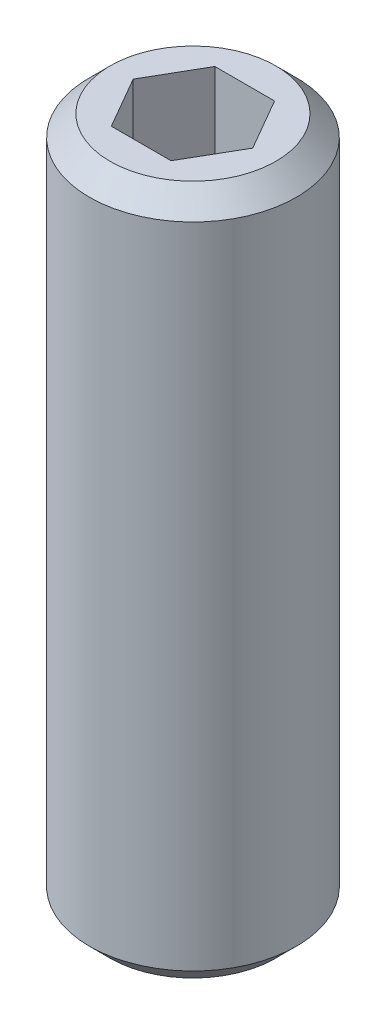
ISO-10303-21;
HEADER;
FILE_DESCRIPTION(('STEP AP214'),'2;1');
FILE_NAME('part.step','',(''),(''),'','','');
FILE_SCHEMA(('AUTOMOTIVE_DESIGN { 1 0 10303 214 1 1 1 1 }'));
ENDSEC;
DATA;
#1=APPLICATION_CONTEXT('core data for automotive mechanical design processes');
#2=APPLICATION_PROTOCOL_DEFINITION('international standard','automotive_design',2000,#1);
#3=PRODUCT_CONTEXT('',#1,'mechanical');
#4=PRODUCT('Part','Part','',(#3));
#5=PRODUCT_RELATED_PRODUCT_CATEGORY('part','',(#4));
#6=PRODUCT_DEFINITION_FORMATION('','',#4);
#7=PRODUCT_DEFINITION_CONTEXT('part definition',#1,'design');
#8=PRODUCT_DEFINITION('design','',#6,#7);
#9=PRODUCT_DEFINITION_SHAPE('','',#8);
#10=(LENGTH_UNIT() NAMED_UNIT(*) SI_UNIT(.MILLI.,.METRE.));
#11=(NAMED_UNIT(*) PLANE_ANGLE_UNIT() SI_UNIT($,.RADIAN.));
#12=(NAMED_UNIT(*) SI_UNIT($,.STERADIAN.) SOLID_ANGLE_UNIT());
#13=UNCERTAINTY_MEASURE_WITH_UNIT(LENGTH_MEASURE(1.E-05),#10,'distance_accuracy_value','');
#14=(GEOMETRIC_REPRESENTATION_CONTEXT(3) GLOBAL_UNCERTAINTY_ASSIGNED_CONTEXT((#13)) GLOBAL_UNIT_ASSIGNED_CONTEXT((#10,
#11,#12)) REPRESENTATION_CONTEXT('',''));
#15=CARTESIAN_POINT('',(0.,0.,0.));
#16=DIRECTION('',(0.,0.,1.));
#17=DIRECTION('',(1.,0.,0.));
#18=AXIS2_PLACEMENT_3D('',#15,#16,#17);
#19=CARTESIAN_POINT('',(0.,-20.,0.));
#20=DIRECTION('',(0.,1.,0.));
#21=DIRECTION('',(0.,0.,1.));
#22=AXIS2_PLACEMENT_3D('',#19,#20,#21);
#23=CYLINDRICAL_SURFACE('',#22,3.);
#24=CARTESIAN_POINT('',(0.,-0.600000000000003,0.));
#25=DIRECTION('',(0.,1.,0.));
#26=DIRECTION('',(0.,0.,1.));
#27=AXIS2_PLACEMENT_3D('',#24,#25,#26);
#28=CIRCLE('',#27,3.);
#29=CARTESIAN_POINT('',(0.,-0.600000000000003,3.));
#30=VERTEX_POINT('',#29);
#31=EDGE_CURVE('E39',#30,#30,#28,.F.);
#32=ORIENTED_EDGE('',*,*,#31,.T.);
#33=EDGE_LOOP('',(#32));
#34=FACE_BOUND('',#33,.T.);
#35=CARTESIAN_POINT('',(0.,-19.4,0.));
#36=DIRECTION('',(0.,1.,0.));
#37=DIRECTION('',(0.,0.,1.));
#38=AXIS2_PLACEMENT_3D('',#35,#36,#37);
#39=CIRCLE('',#38,3.);
#40=CARTESIAN_POINT('',(0.,-19.4,3.));
#41=VERTEX_POINT('',#40);
#42=EDGE_CURVE('E142',#41,#41,#39,.T.);
#43=ORIENTED_EDGE('',*,*,#42,.T.);
#44=EDGE_LOOP('',(#43));
#45=FACE_BOUND('',#44,.T.);
#46=ADVANCED_FACE('F32',(#34,#45),#23,.T.);
#47=CARTESIAN_POINT('',(0.,-20.,0.));
#48=DIRECTION('',(0.,1.,0.));
#49=DIRECTION('',(0.,0.,1.));
#50=AXIS2_PLACEMENT_3D('',#47,#48,#49);
#51=PLANE('',#50);
#52=CARTESIAN_POINT('',(0.,-20.,0.));
#53=DIRECTION('',(0.,1.,0.));
#54=DIRECTION('',(0.,0.,1.));
#55=AXIS2_PLACEMENT_3D('',#52,#53,#54);
#56=CIRCLE('',#55,2.39999999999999);
#57=CARTESIAN_POINT('',(0.,-20.,2.39999999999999));
#58=VERTEX_POINT('',#57);
#59=EDGE_CURVE('E11',#58,#58,#56,.F.);
#60=ORIENTED_EDGE('',*,*,#59,.T.);
#61=EDGE_LOOP('',(#60));
#62=FACE_BOUND('',#61,.T.);
#63=ADVANCED_FACE('F159',(#62),#51,.F.);
#64=CARTESIAN_POINT('',(0.,0.,0.));
#65=DIRECTION('',(0.,1.,0.));
#66=DIRECTION('',(0.,0.,1.));
#67=AXIS2_PLACEMENT_3D('',#64,#65,#66);
#68=PLANE('',#67);
#69=CARTESIAN_POINT('',(0.,0.,0.));
#70=DIRECTION('',(0.,1.,0.));
#71=DIRECTION('',(0.,0.,1.));
#72=AXIS2_PLACEMENT_3D('',#69,#70,#71);
#73=CIRCLE('',#72,2.4);
#74=CARTESIAN_POINT('',(0.,0.,2.4));
#75=VERTEX_POINT('',#74);
#76=EDGE_CURVE('E133',#75,#75,#73,.T.);
#77=ORIENTED_EDGE('',*,*,#76,.T.);
#78=EDGE_LOOP('',(#77));
#79=FACE_BOUND('',#78,.T.);
#80=DIRECTION('',(-1.,0.,0.));
#81=VECTOR('',#80,1.);
#82=CARTESIAN_POINT('',(0.866025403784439,0.,-1.5));
#83=LINE('',#82,#81);
#84=CARTESIAN_POINT('',(0.866025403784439,0.,-1.5));
#85=VERTEX_POINT('',#84);
#86=CARTESIAN_POINT('',(-0.866025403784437,0.,-1.5));
#87=VERTEX_POINT('',#86);
#88=EDGE_CURVE('E46',#85,#87,#83,.T.);
#89=ORIENTED_EDGE('',*,*,#88,.F.);
#90=DIRECTION('',(-0.5,0.,-0.866025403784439));
#91=VECTOR('',#90,1.);
#92=CARTESIAN_POINT('',(1.73205080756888,0.,0.));
#93=LINE('',#92,#91);
#94=CARTESIAN_POINT('',(1.73205080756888,0.,0.));
#95=VERTEX_POINT('',#94);
#96=EDGE_CURVE('E115',#95,#85,#93,.T.);
#97=ORIENTED_EDGE('',*,*,#96,.F.);
#98=DIRECTION('',(0.5,0.,-0.866025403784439));
#99=VECTOR('',#98,1.);
#100=CARTESIAN_POINT('',(0.866025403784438,0.,1.5));
#101=LINE('',#100,#99);
#102=CARTESIAN_POINT('',(0.866025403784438,0.,1.5));
#103=VERTEX_POINT('',#102);
#104=EDGE_CURVE('E109',#103,#95,#101,.T.);
#105=ORIENTED_EDGE('',*,*,#104,.F.);
#106=DIRECTION('',(1.,0.,0.));
#107=VECTOR('',#106,1.);
#108=CARTESIAN_POINT('',(-0.866025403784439,0.,1.5));
#109=LINE('',#108,#107);
#110=CARTESIAN_POINT('',(-0.866025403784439,0.,1.5));
#111=VERTEX_POINT('',#110);
#112=EDGE_CURVE('E107',#111,#103,#109,.T.);
#113=ORIENTED_EDGE('',*,*,#112,.F.);
#114=DIRECTION('',(0.5,0.,0.866025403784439));
#115=VECTOR('',#114,1.);
#116=CARTESIAN_POINT('',(-1.73205080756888,0.,0.));
#117=LINE('',#116,#115);
#118=CARTESIAN_POINT('',(-1.73205080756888,0.,0.));
#119=VERTEX_POINT('',#118);
#120=EDGE_CURVE('E89',#119,#111,#117,.T.);
#121=ORIENTED_EDGE('',*,*,#120,.F.);
#122=DIRECTION('',(-0.5,0.,0.866025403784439));
#123=VECTOR('',#122,1.);
#124=CARTESIAN_POINT('',(-0.866025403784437,0.,-1.5));
#125=LINE('',#124,#123);
#126=EDGE_CURVE('E100',#87,#119,#125,.T.);
#127=ORIENTED_EDGE('',*,*,#126,.F.);
#128=EDGE_LOOP('',(#89,#97,#105,#113,#121,#127));
#129=FACE_BOUND('',#128,.T.);
#130=ADVANCED_FACE('F104',(#79,#129),#68,.T.);
#131=CARTESIAN_POINT('',(0.866025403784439,-3.,-1.5));
#132=DIRECTION('',(0.,0.,-1.));
#133=DIRECTION('',(-1.,0.,0.));
#134=AXIS2_PLACEMENT_3D('',#131,#132,#133);
#135=PLANE('',#134);
#136=ORIENTED_EDGE('',*,*,#88,.T.);
#137=DIRECTION('',(0.,1.,0.));
#138=VECTOR('',#137,1.);
#139=CARTESIAN_POINT('',(-0.866025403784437,-3.,-1.5));
#140=LINE('',#139,#138);
#141=CARTESIAN_POINT('',(-0.866025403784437,-3.,-1.5));
#142=VERTEX_POINT('',#141);
#143=EDGE_CURVE('E97',#142,#87,#140,.T.);
#144=ORIENTED_EDGE('',*,*,#143,.F.);
#145=DIRECTION('',(-1.,0.,0.));
#146=VECTOR('',#145,1.);
#147=CARTESIAN_POINT('',(0.866025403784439,-3.,-1.5));
#148=LINE('',#147,#146);
#149=CARTESIAN_POINT('',(0.866025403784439,-3.,-1.5));
#150=VERTEX_POINT('',#149);
#151=EDGE_CURVE('E117',#150,#142,#148,.T.);
#152=ORIENTED_EDGE('',*,*,#151,.F.);
#153=DIRECTION('',(0.,1.,0.));
#154=VECTOR('',#153,1.);
#155=CARTESIAN_POINT('',(0.866025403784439,-3.,-1.5));
#156=LINE('',#155,#154);
#157=EDGE_CURVE('E53',#150,#85,#156,.T.);
#158=ORIENTED_EDGE('',*,*,#157,.T.);
#159=EDGE_LOOP('',(#136,#144,#152,#158));
#160=FACE_BOUND('',#159,.T.);
#161=ADVANCED_FACE('F158',(#160),#135,.F.);
#162=CARTESIAN_POINT('',(1.73205080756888,-3.,0.));
#163=DIRECTION('',(0.866025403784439,0.,-0.5));
#164=DIRECTION('',(-0.5,0.,-0.866025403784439));
#165=AXIS2_PLACEMENT_3D('',#162,#163,#164);
#166=PLANE('',#165);
#167=ORIENTED_EDGE('',*,*,#96,.T.);
#168=ORIENTED_EDGE('',*,*,#157,.F.);
#169=DIRECTION('',(-0.5,0.,-0.866025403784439));
#170=VECTOR('',#169,1.);
#171=CARTESIAN_POINT('',(1.73205080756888,-3.,0.));
#172=LINE('',#171,#170);
#173=CARTESIAN_POINT('',(1.73205080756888,-3.,0.));
#174=VERTEX_POINT('',#173);
#175=EDGE_CURVE('E129',#174,#150,#172,.T.);
#176=ORIENTED_EDGE('',*,*,#175,.F.);
#177=DIRECTION('',(0.,1.,0.));
#178=VECTOR('',#177,1.);
#179=CARTESIAN_POINT('',(1.73205080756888,-3.,0.));
#180=LINE('',#179,#178);
#181=EDGE_CURVE('E134',#174,#95,#180,.T.);
#182=ORIENTED_EDGE('',*,*,#181,.T.);
#183=EDGE_LOOP('',(#167,#168,#176,#182));
#184=FACE_BOUND('',#183,.T.);
#185=ADVANCED_FACE('F165',(#184),#166,.F.);
#186=CARTESIAN_POINT('',(0.866025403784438,-3.,1.5));
#187=DIRECTION('',(0.866025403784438,0.,0.5));
#188=DIRECTION('',(0.5,0.,-0.866025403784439));
#189=AXIS2_PLACEMENT_3D('',#186,#187,#188);
#190=PLANE('',#189);
#191=ORIENTED_EDGE('',*,*,#104,.T.);
#192=ORIENTED_EDGE('',*,*,#181,.F.);
#193=DIRECTION('',(0.5,0.,-0.866025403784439));
#194=VECTOR('',#193,1.);
#195=CARTESIAN_POINT('',(0.866025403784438,-3.,1.5));
#196=LINE('',#195,#194);
#197=CARTESIAN_POINT('',(0.866025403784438,-3.,1.5));
#198=VERTEX_POINT('',#197);
#199=EDGE_CURVE('E126',#198,#174,#196,.T.);
#200=ORIENTED_EDGE('',*,*,#199,.F.);
#201=DIRECTION('',(0.,1.,0.));
#202=VECTOR('',#201,1.);
#203=CARTESIAN_POINT('',(0.866025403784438,-3.,1.5));
#204=LINE('',#203,#202);
#205=EDGE_CURVE('E136',#198,#103,#204,.T.);
#206=ORIENTED_EDGE('',*,*,#205,.T.);
#207=EDGE_LOOP('',(#191,#192,#200,#206));
#208=FACE_BOUND('',#207,.T.);
#209=ADVANCED_FACE('F209',(#208),#190,.F.);
#210=CARTESIAN_POINT('',(-0.866025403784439,-3.,1.5));
#211=DIRECTION('',(0.,0.,1.));
#212=DIRECTION('',(1.,0.,0.));
#213=AXIS2_PLACEMENT_3D('',#210,#211,#212);
#214=PLANE('',#213);
#215=ORIENTED_EDGE('',*,*,#112,.T.);
#216=ORIENTED_EDGE('',*,*,#205,.F.);
#217=DIRECTION('',(1.,0.,0.));
#218=VECTOR('',#217,1.);
#219=CARTESIAN_POINT('',(-0.866025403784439,-3.,1.5));
#220=LINE('',#219,#218);
#221=CARTESIAN_POINT('',(-0.866025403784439,-3.,1.5));
#222=VERTEX_POINT('',#221);
#223=EDGE_CURVE('E123',#222,#198,#220,.T.);
#224=ORIENTED_EDGE('',*,*,#223,.F.);
#225=DIRECTION('',(0.,1.,0.));
#226=VECTOR('',#225,1.);
#227=CARTESIAN_POINT('',(-0.866025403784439,-3.,1.5));
#228=LINE('',#227,#226);
#229=EDGE_CURVE('E96',#222,#111,#228,.T.);
#230=ORIENTED_EDGE('',*,*,#229,.T.);
#231=EDGE_LOOP('',(#215,#216,#224,#230));
#232=FACE_BOUND('',#231,.T.);
#233=ADVANCED_FACE('F212',(#232),#214,.F.);
#234=CARTESIAN_POINT('',(-1.73205080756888,-3.,0.));
#235=DIRECTION('',(-0.866025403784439,0.,0.5));
#236=DIRECTION('',(0.5,0.,0.866025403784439));
#237=AXIS2_PLACEMENT_3D('',#234,#235,#236);
#238=PLANE('',#237);
#239=ORIENTED_EDGE('',*,*,#120,.T.);
#240=ORIENTED_EDGE('',*,*,#229,.F.);
#241=DIRECTION('',(0.5,0.,0.866025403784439));
#242=VECTOR('',#241,1.);
#243=CARTESIAN_POINT('',(-1.73205080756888,-3.,0.));
#244=LINE('',#243,#242);
#245=CARTESIAN_POINT('',(-1.73205080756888,-3.,0.));
#246=VERTEX_POINT('',#245);
#247=EDGE_CURVE('E92',#246,#222,#244,.T.);
#248=ORIENTED_EDGE('',*,*,#247,.F.);
#249=DIRECTION('',(0.,1.,0.));
#250=VECTOR('',#249,1.);
#251=CARTESIAN_POINT('',(-1.73205080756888,-3.,0.));
#252=LINE('',#251,#250);
#253=EDGE_CURVE('E85',#246,#119,#252,.T.);
#254=ORIENTED_EDGE('',*,*,#253,.T.);
#255=EDGE_LOOP('',(#239,#240,#248,#254));
#256=FACE_BOUND('',#255,.T.);
#257=ADVANCED_FACE('F87',(#256),#238,.F.);
#258=CARTESIAN_POINT('',(-0.866025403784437,-3.,-1.5));
#259=DIRECTION('',(-0.866025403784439,0.,-0.5));
#260=DIRECTION('',(-0.5,0.,0.866025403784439));
#261=AXIS2_PLACEMENT_3D('',#258,#259,#260);
#262=PLANE('',#261);
#263=ORIENTED_EDGE('',*,*,#126,.T.);
#264=ORIENTED_EDGE('',*,*,#253,.F.);
#265=DIRECTION('',(-0.5,0.,0.866025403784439));
#266=VECTOR('',#265,1.);
#267=CARTESIAN_POINT('',(-0.866025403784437,-3.,-1.5));
#268=LINE('',#267,#266);
#269=EDGE_CURVE('E120',#142,#246,#268,.T.);
#270=ORIENTED_EDGE('',*,*,#269,.F.);
#271=ORIENTED_EDGE('',*,*,#143,.T.);
#272=EDGE_LOOP('',(#263,#264,#270,#271));
#273=FACE_BOUND('',#272,.T.);
#274=ADVANCED_FACE('F101',(#273),#262,.F.);
#275=CARTESIAN_POINT('',(0.866025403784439,-3.,-1.5));
#276=DIRECTION('',(0.,-1.,0.));
#277=DIRECTION('',(0.,0.,-1.));
#278=AXIS2_PLACEMENT_3D('',#275,#276,#277);
#279=PLANE('',#278);
#280=ORIENTED_EDGE('',*,*,#151,.T.);
#281=ORIENTED_EDGE('',*,*,#269,.T.);
#282=ORIENTED_EDGE('',*,*,#247,.T.);
#283=ORIENTED_EDGE('',*,*,#223,.T.);
#284=ORIENTED_EDGE('',*,*,#199,.T.);
#285=ORIENTED_EDGE('',*,*,#175,.T.);
#286=EDGE_LOOP('',(#280,#281,#282,#283,#284,#285));
#287=FACE_BOUND('',#286,.T.);
#288=ADVANCED_FACE('F153',(#287),#279,.F.);
#289=CARTESIAN_POINT('',(0.,0.,0.));
#290=DIRECTION('',(0.,-1.,0.));
#291=DIRECTION('',(0.,0.,-1.));
#292=AXIS2_PLACEMENT_3D('',#289,#290,#291);
#293=CONICAL_SURFACE('',#292,2.4,0.785398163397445);
#294=ORIENTED_EDGE('',*,*,#31,.F.);
#295=EDGE_LOOP('',(#294));
#296=FACE_BOUND('',#295,.T.);
#297=ORIENTED_EDGE('',*,*,#76,.F.);
#298=EDGE_LOOP('',(#297));
#299=FACE_BOUND('',#298,.T.);
#300=ADVANCED_FACE('F149',(#296,#299),#293,.T.);
#301=CARTESIAN_POINT('',(0.,-19.4,0.));
#302=DIRECTION('',(0.,1.,0.));
#303=DIRECTION('',(0.,0.,1.));
#304=AXIS2_PLACEMENT_3D('',#301,#302,#303);
#305=CONICAL_SURFACE('',#304,3.,0.785398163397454);
#306=ORIENTED_EDGE('',*,*,#59,.F.);
#307=EDGE_LOOP('',(#306));
#308=FACE_BOUND('',#307,.T.);
#309=ORIENTED_EDGE('',*,*,#42,.F.);
#310=EDGE_LOOP('',(#309));
#311=FACE_BOUND('',#310,.T.);
#312=ADVANCED_FACE('F152',(#308,#311),#305,.T.);
#313=CLOSED_SHELL('',(#46,#63,#130,#161,#185,#209,#233,#257,#274,#288,#300,#312));
#314=MANIFOLD_SOLID_BREP('B2',#313);
#315=ADVANCED_BREP_SHAPE_REPRESENTATION('',(#18,#314),#14);
#316=SHAPE_DEFINITION_REPRESENTATION(#9,#315);
ENDSEC;
END-ISO-10303-21;
